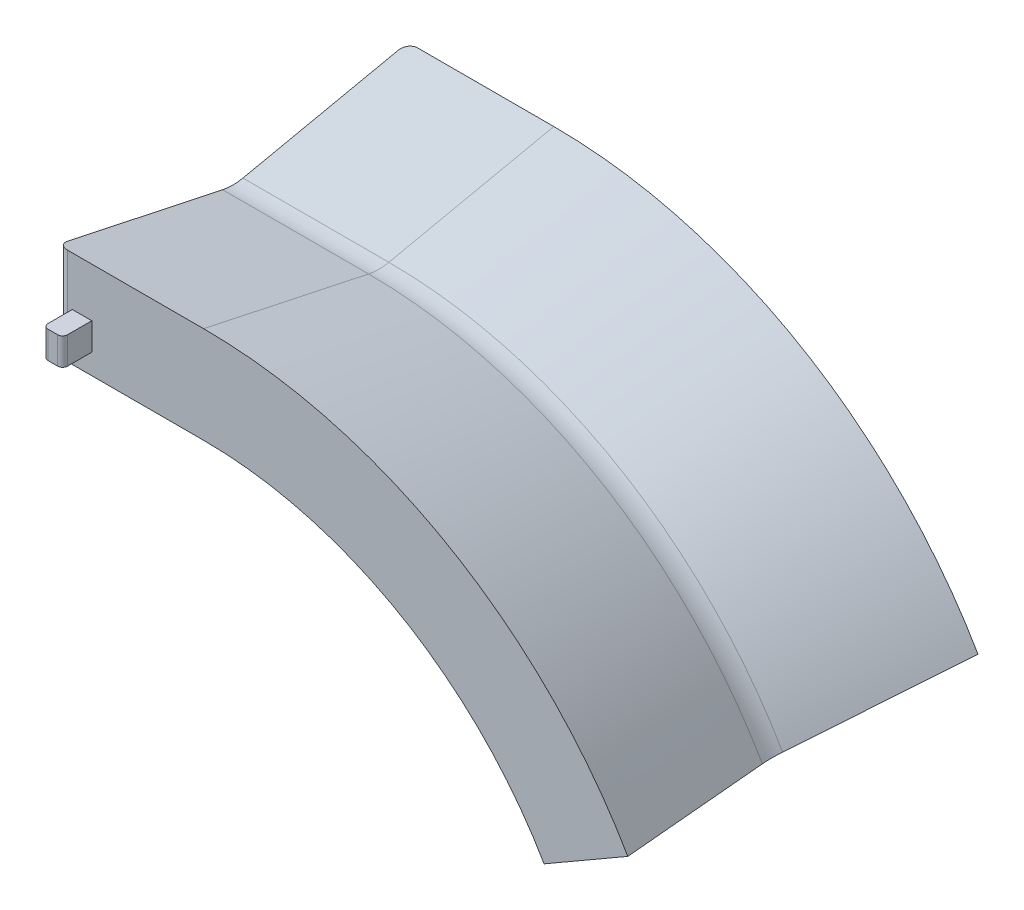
ISO-10303-21;
HEADER;
FILE_DESCRIPTION(('STEP AP214'),'2;1');
FILE_NAME('part.step','',(''),(''),'','','');
FILE_SCHEMA(('AUTOMOTIVE_DESIGN { 1 0 10303 214 1 1 1 1 }'));
ENDSEC;
DATA;
#1=APPLICATION_CONTEXT('core data for automotive mechanical design processes');
#2=APPLICATION_PROTOCOL_DEFINITION('international standard','automotive_design',2000,#1);
#3=PRODUCT_CONTEXT('',#1,'mechanical');
#4=PRODUCT('Part','Part','',(#3));
#5=PRODUCT_RELATED_PRODUCT_CATEGORY('part','',(#4));
#6=PRODUCT_DEFINITION_FORMATION('','',#4);
#7=PRODUCT_DEFINITION_CONTEXT('part definition',#1,'design');
#8=PRODUCT_DEFINITION('design','',#6,#7);
#9=PRODUCT_DEFINITION_SHAPE('','',#8);
#10=(LENGTH_UNIT() NAMED_UNIT(*) SI_UNIT(.MILLI.,.METRE.));
#11=(NAMED_UNIT(*) PLANE_ANGLE_UNIT() SI_UNIT($,.RADIAN.));
#12=(NAMED_UNIT(*) SI_UNIT($,.STERADIAN.) SOLID_ANGLE_UNIT());
#13=UNCERTAINTY_MEASURE_WITH_UNIT(LENGTH_MEASURE(1.E-05),#10,'distance_accuracy_value','');
#14=(GEOMETRIC_REPRESENTATION_CONTEXT(3) GLOBAL_UNCERTAINTY_ASSIGNED_CONTEXT((#13)) GLOBAL_UNIT_ASSIGNED_CONTEXT((#10,
#11,#12)) REPRESENTATION_CONTEXT('',''));
#15=CARTESIAN_POINT('',(0.,0.,0.));
#16=DIRECTION('',(0.,0.,1.));
#17=DIRECTION('',(1.,0.,0.));
#18=AXIS2_PLACEMENT_3D('',#15,#16,#17);
#19=CARTESIAN_POINT('',(15.,9.93929936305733,-18.));
#20=DIRECTION('',(0.,0.,1.));
#21=DIRECTION('',(1.,0.,0.));
#22=AXIS2_PLACEMENT_3D('',#19,#20,#21);
#23=PLANE('',#22);
#24=DIRECTION('',(-1.,0.,0.));
#25=VECTOR('',#24,1.);
#26=CARTESIAN_POINT('',(15.,0.,-18.));
#27=LINE('',#26,#25);
#28=CARTESIAN_POINT('',(15.,0.,-18.));
#29=VERTEX_POINT('',#28);
#30=CARTESIAN_POINT('',(1.,0.,-18.));
#31=VERTEX_POINT('',#30);
#32=EDGE_CURVE('E317',#29,#31,#27,.T.);
#33=ORIENTED_EDGE('',*,*,#32,.T.);
#34=DIRECTION('',(0.,1.,0.));
#35=VECTOR('',#34,1.);
#36=CARTESIAN_POINT('',(1.,9.93929936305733,-18.));
#37=LINE('',#36,#35);
#38=CARTESIAN_POINT('',(1.,9.93929936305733,-18.));
#39=VERTEX_POINT('',#38);
#40=EDGE_CURVE('E365',#31,#39,#37,.T.);
#41=ORIENTED_EDGE('',*,*,#40,.T.);
#42=DIRECTION('',(-1.,0.,0.));
#43=VECTOR('',#42,1.);
#44=CARTESIAN_POINT('',(15.,9.93929936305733,-18.));
#45=LINE('',#44,#43);
#46=CARTESIAN_POINT('',(15.,9.93929936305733,-18.));
#47=VERTEX_POINT('',#46);
#48=EDGE_CURVE('E314',#47,#39,#45,.T.);
#49=ORIENTED_EDGE('',*,*,#48,.F.);
#50=CARTESIAN_POINT('',(15.,-40.4145188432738,-18.));
#51=DIRECTION('',(0.,0.,-1.));
#52=DIRECTION('',(-1.,0.,0.));
#53=AXIS2_PLACEMENT_3D('',#50,#51,#52);
#54=CIRCLE('',#53,50.3538182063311);
#55=CARTESIAN_POINT('',(58.6076857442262,-15.2376097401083,-18.));
#56=VERTEX_POINT('',#55);
#57=EDGE_CURVE('E350',#47,#56,#54,.T.);
#58=ORIENTED_EDGE('',*,*,#57,.T.);
#59=DIRECTION('',(0.86602540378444,0.499999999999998,0.));
#60=VECTOR('',#59,1.);
#61=CARTESIAN_POINT('',(58.6076857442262,-15.2376097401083,-18.));
#62=LINE('',#61,#60);
#63=CARTESIAN_POINT('',(50.,-20.207259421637,-18.));
#64=VERTEX_POINT('',#63);
#65=EDGE_CURVE('E335',#64,#56,#62,.T.);
#66=ORIENTED_EDGE('',*,*,#65,.F.);
#67=CARTESIAN_POINT('',(15.,-40.4145188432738,-18.));
#68=DIRECTION('',(0.,0.,-1.));
#69=DIRECTION('',(-1.,0.,0.));
#70=AXIS2_PLACEMENT_3D('',#67,#68,#69);
#71=CIRCLE('',#70,40.4145188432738);
#72=EDGE_CURVE('E353',#29,#64,#71,.T.);
#73=ORIENTED_EDGE('',*,*,#72,.F.);
#74=EDGE_LOOP('',(#33,#41,#49,#58,#66,#73));
#75=FACE_BOUND('',#74,.T.);
#76=DIRECTION('',(-1.,0.,0.));
#77=VECTOR('',#76,1.);
#78=CARTESIAN_POINT('',(1.5,2.1,-18.));
#79=LINE('',#78,#77);
#80=CARTESIAN_POINT('',(3.5,2.1,-18.));
#81=VERTEX_POINT('',#80);
#82=CARTESIAN_POINT('',(1.5,2.1,-18.));
#83=VERTEX_POINT('',#82);
#84=EDGE_CURVE('E195',#81,#83,#79,.T.);
#85=ORIENTED_EDGE('',*,*,#84,.F.);
#86=DIRECTION('',(0.,1.,0.));
#87=VECTOR('',#86,1.);
#88=CARTESIAN_POINT('',(3.5,2.1,-18.));
#89=LINE('',#88,#87);
#90=CARTESIAN_POINT('',(3.5,4.9,-18.));
#91=VERTEX_POINT('',#90);
#92=EDGE_CURVE('E203',#81,#91,#89,.T.);
#93=ORIENTED_EDGE('',*,*,#92,.T.);
#94=DIRECTION('',(-1.,0.,0.));
#95=VECTOR('',#94,1.);
#96=CARTESIAN_POINT('',(1.5,4.9,-18.));
#97=LINE('',#96,#95);
#98=CARTESIAN_POINT('',(1.5,4.9,-18.));
#99=VERTEX_POINT('',#98);
#100=EDGE_CURVE('E224',#91,#99,#97,.T.);
#101=ORIENTED_EDGE('',*,*,#100,.T.);
#102=DIRECTION('',(0.,1.,0.));
#103=VECTOR('',#102,1.);
#104=CARTESIAN_POINT('',(1.5,2.1,-18.));
#105=LINE('',#104,#103);
#106=EDGE_CURVE('E50',#83,#99,#105,.T.);
#107=ORIENTED_EDGE('',*,*,#106,.F.);
#108=EDGE_LOOP('',(#85,#93,#101,#107));
#109=FACE_BOUND('',#108,.T.);
#110=ADVANCED_FACE('F35',(#75,#109),#23,.F.);
#111=CARTESIAN_POINT('',(15.,9.93929936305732,18.));
#112=DIRECTION('',(0.,0.,-1.));
#113=DIRECTION('',(-1.,0.,0.));
#114=AXIS2_PLACEMENT_3D('',#111,#112,#113);
#115=PLANE('',#114);
#116=DIRECTION('',(-1.,0.,0.));
#117=VECTOR('',#116,1.);
#118=CARTESIAN_POINT('',(15.,9.93929936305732,18.));
#119=LINE('',#118,#117);
#120=CARTESIAN_POINT('',(15.,9.93929936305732,18.));
#121=VERTEX_POINT('',#120);
#122=CARTESIAN_POINT('',(1.,9.93929936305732,18.));
#123=VERTEX_POINT('',#122);
#124=EDGE_CURVE('E323',#121,#123,#119,.T.);
#125=ORIENTED_EDGE('',*,*,#124,.T.);
#126=DIRECTION('',(0.,-1.,0.));
#127=VECTOR('',#126,1.);
#128=CARTESIAN_POINT('',(1.,0.,18.));
#129=LINE('',#128,#127);
#130=CARTESIAN_POINT('',(1.,0.,18.));
#131=VERTEX_POINT('',#130);
#132=EDGE_CURVE('E43',#123,#131,#129,.T.);
#133=ORIENTED_EDGE('',*,*,#132,.T.);
#134=DIRECTION('',(-1.,0.,0.));
#135=VECTOR('',#134,1.);
#136=CARTESIAN_POINT('',(15.,0.,18.));
#137=LINE('',#136,#135);
#138=CARTESIAN_POINT('',(15.,0.,18.));
#139=VERTEX_POINT('',#138);
#140=EDGE_CURVE('E320',#139,#131,#137,.T.);
#141=ORIENTED_EDGE('',*,*,#140,.F.);
#142=CARTESIAN_POINT('',(15.,-40.4145188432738,18.));
#143=DIRECTION('',(0.,0.,-1.));
#144=DIRECTION('',(-1.,0.,0.));
#145=AXIS2_PLACEMENT_3D('',#142,#143,#144);
#146=CIRCLE('',#145,40.4145188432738);
#147=CARTESIAN_POINT('',(50.,-20.207259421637,18.));
#148=VERTEX_POINT('',#147);
#149=EDGE_CURVE('E356',#139,#148,#146,.T.);
#150=ORIENTED_EDGE('',*,*,#149,.T.);
#151=DIRECTION('',(-0.86602540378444,-0.499999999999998,0.));
#152=VECTOR('',#151,1.);
#153=CARTESIAN_POINT('',(58.6076857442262,-15.2376097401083,18.));
#154=LINE('',#153,#152);
#155=CARTESIAN_POINT('',(58.6076857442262,-15.2376097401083,18.));
#156=VERTEX_POINT('',#155);
#157=EDGE_CURVE('E341',#156,#148,#154,.T.);
#158=ORIENTED_EDGE('',*,*,#157,.F.);
#159=CARTESIAN_POINT('',(15.,-40.4145188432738,18.));
#160=DIRECTION('',(0.,0.,-1.));
#161=DIRECTION('',(-1.,0.,0.));
#162=AXIS2_PLACEMENT_3D('',#159,#160,#161);
#163=CIRCLE('',#162,50.3538182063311);
#164=EDGE_CURVE('E359',#121,#156,#163,.T.);
#165=ORIENTED_EDGE('',*,*,#164,.F.);
#166=EDGE_LOOP('',(#125,#133,#141,#150,#158,#165));
#167=FACE_BOUND('',#166,.T.);
#168=DIRECTION('',(-1.,0.,0.));
#169=VECTOR('',#168,1.);
#170=CARTESIAN_POINT('',(1.5,2.1,18.));
#171=LINE('',#170,#169);
#172=CARTESIAN_POINT('',(3.5,2.1,18.));
#173=VERTEX_POINT('',#172);
#174=CARTESIAN_POINT('',(1.5,2.1,18.));
#175=VERTEX_POINT('',#174);
#176=EDGE_CURVE('E244',#173,#175,#171,.T.);
#177=ORIENTED_EDGE('',*,*,#176,.T.);
#178=DIRECTION('',(0.,1.,0.));
#179=VECTOR('',#178,1.);
#180=CARTESIAN_POINT('',(1.5,2.1,18.));
#181=LINE('',#180,#179);
#182=CARTESIAN_POINT('',(1.5,4.9,18.));
#183=VERTEX_POINT('',#182);
#184=EDGE_CURVE('E262',#175,#183,#181,.T.);
#185=ORIENTED_EDGE('',*,*,#184,.T.);
#186=DIRECTION('',(-1.,0.,0.));
#187=VECTOR('',#186,1.);
#188=CARTESIAN_POINT('',(1.5,4.9,18.));
#189=LINE('',#188,#187);
#190=CARTESIAN_POINT('',(3.5,4.9,18.));
#191=VERTEX_POINT('',#190);
#192=EDGE_CURVE('E233',#191,#183,#189,.T.);
#193=ORIENTED_EDGE('',*,*,#192,.F.);
#194=DIRECTION('',(0.,1.,0.));
#195=VECTOR('',#194,1.);
#196=CARTESIAN_POINT('',(3.5,2.1,18.));
#197=LINE('',#196,#195);
#198=EDGE_CURVE('E276',#173,#191,#197,.T.);
#199=ORIENTED_EDGE('',*,*,#198,.F.);
#200=EDGE_LOOP('',(#177,#185,#193,#199));
#201=FACE_BOUND('',#200,.T.);
#202=ADVANCED_FACE('F381',(#167,#201),#115,.F.);
#203=CARTESIAN_POINT('',(15.,-40.4145188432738,1.04041140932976));
#204=DIRECTION('',(0.,0.,1.));
#205=DIRECTION('',(1.,0.,0.));
#206=AXIS2_PLACEMENT_3D('',#203,#204,#205);
#207=CONICAL_SURFACE('',#206,46.7458547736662,0.209613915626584);
#208=DIRECTION('',(0.,0.208082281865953,0.978111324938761));
#209=VECTOR('',#208,1.);
#210=CARTESIAN_POINT('',(15.,9.93929936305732,18.));
#211=LINE('',#210,#209);
#212=CARTESIAN_POINT('',(15.,6.33133593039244,1.04041140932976));
#213=VERTEX_POINT('',#212);
#214=EDGE_CURVE('E292',#213,#121,#211,.T.);
#215=ORIENTED_EDGE('',*,*,#214,.T.);
#216=ORIENTED_EDGE('',*,*,#164,.T.);
#217=DIRECTION('',(0.180204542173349,0.104041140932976,0.978111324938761));
#218=VECTOR('',#217,1.);
#219=CARTESIAN_POINT('',(58.6076857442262,-15.2376097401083,18.));
#220=LINE('',#219,#218);
#221=CARTESIAN_POINT('',(55.4830977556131,-17.0415914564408,1.04041140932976));
#222=VERTEX_POINT('',#221);
#223=EDGE_CURVE('E344',#222,#156,#220,.T.);
#224=ORIENTED_EDGE('',*,*,#223,.F.);
#225=CARTESIAN_POINT('',(15.,-40.4145188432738,1.04041140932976));
#226=DIRECTION('',(0.,0.,-1.));
#227=DIRECTION('',(-1.,0.,0.));
#228=AXIS2_PLACEMENT_3D('',#225,#226,#227);
#229=CIRCLE('',#228,46.7458547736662);
#230=EDGE_CURVE('E362',#213,#222,#229,.T.);
#231=ORIENTED_EDGE('',*,*,#230,.F.);
#232=EDGE_LOOP('',(#215,#216,#224,#231));
#233=FACE_BOUND('',#232,.T.);
#234=ADVANCED_FACE('F396',(#233),#207,.T.);
#235=CARTESIAN_POINT('',(15.,-40.4145188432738,0.));
#236=DIRECTION('',(0.,0.,-1.));
#237=DIRECTION('',(-1.,0.,0.));
#238=AXIS2_PLACEMENT_3D('',#235,#236,#237);
#239=CYLINDRICAL_SURFACE('',#238,40.4145188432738);
#240=DIRECTION('',(0.,0.,-1.));
#241=VECTOR('',#240,1.);
#242=CARTESIAN_POINT('',(15.,0.,18.));
#243=LINE('',#242,#241);
#244=EDGE_CURVE('E296',#139,#29,#243,.T.);
#245=ORIENTED_EDGE('',*,*,#244,.T.);
#246=ORIENTED_EDGE('',*,*,#72,.T.);
#247=DIRECTION('',(0.,0.,-1.));
#248=VECTOR('',#247,1.);
#249=CARTESIAN_POINT('',(50.,-20.207259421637,18.));
#250=LINE('',#249,#248);
#251=EDGE_CURVE('E338',#148,#64,#250,.T.);
#252=ORIENTED_EDGE('',*,*,#251,.F.);
#253=ORIENTED_EDGE('',*,*,#149,.F.);
#254=EDGE_LOOP('',(#245,#246,#252,#253));
#255=FACE_BOUND('',#254,.T.);
#256=ADVANCED_FACE('F392',(#255),#239,.F.);
#257=CARTESIAN_POINT('',(15.,-40.4145188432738,-18.));
#258=DIRECTION('',(0.,0.,-1.));
#259=DIRECTION('',(-1.,0.,0.));
#260=AXIS2_PLACEMENT_3D('',#257,#258,#259);
#261=CONICAL_SURFACE('',#260,50.3538182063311,0.209613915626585);
#262=DIRECTION('',(0.,-0.208082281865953,0.978111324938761));
#263=VECTOR('',#262,1.);
#264=CARTESIAN_POINT('',(15.,9.93929936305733,-18.));
#265=LINE('',#264,#263);
#266=CARTESIAN_POINT('',(15.,6.33133593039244,-1.04041140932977));
#267=VERTEX_POINT('',#266);
#268=EDGE_CURVE('E299',#47,#267,#265,.T.);
#269=ORIENTED_EDGE('',*,*,#268,.T.);
#270=CARTESIAN_POINT('',(15.,-40.4145188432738,-1.04041140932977));
#271=DIRECTION('',(0.,0.,-1.));
#272=DIRECTION('',(-1.,0.,0.));
#273=AXIS2_PLACEMENT_3D('',#270,#271,#272);
#274=CIRCLE('',#273,46.7458547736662);
#275=CARTESIAN_POINT('',(55.4830977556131,-17.0415914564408,-1.04041140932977));
#276=VERTEX_POINT('',#275);
#277=EDGE_CURVE('E347',#267,#276,#274,.T.);
#278=ORIENTED_EDGE('',*,*,#277,.T.);
#279=DIRECTION('',(-0.18020454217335,-0.104041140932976,0.978111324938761));
#280=VECTOR('',#279,1.);
#281=CARTESIAN_POINT('',(58.6076857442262,-15.2376097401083,-18.));
#282=LINE('',#281,#280);
#283=EDGE_CURVE('E332',#56,#276,#282,.T.);
#284=ORIENTED_EDGE('',*,*,#283,.F.);
#285=ORIENTED_EDGE('',*,*,#57,.F.);
#286=EDGE_LOOP('',(#269,#278,#284,#285));
#287=FACE_BOUND('',#286,.T.);
#288=ADVANCED_FACE('F419',(#287),#261,.T.);
#289=CARTESIAN_POINT('',(15.,-40.4145188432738,0.));
#290=DIRECTION('',(0.,0.,-1.));
#291=DIRECTION('',(-1.,0.,0.));
#292=AXIS2_PLACEMENT_3D('',#289,#290,#291);
#293=TOROIDAL_SURFACE('',#292,51.63641139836,5.);
#294=CARTESIAN_POINT('',(15.,11.2218925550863,0.));
#295=DIRECTION('',(-1.,0.,0.));
#296=DIRECTION('',(0.,0.,1.));
#297=AXIS2_PLACEMENT_3D('',#294,#295,#296);
#298=CIRCLE('',#297,5.);
#299=EDGE_CURVE('E289',#267,#213,#298,.T.);
#300=ORIENTED_EDGE('',*,*,#299,.T.);
#301=ORIENTED_EDGE('',*,*,#230,.T.);
#302=CARTESIAN_POINT('',(59.7184440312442,-14.5963131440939,0.));
#303=DIRECTION('',(-0.499999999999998,0.86602540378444,0.));
#304=DIRECTION('',(0.,0.,1.));
#305=AXIS2_PLACEMENT_3D('',#302,#303,#304);
#306=CIRCLE('',#305,5.);
#307=EDGE_CURVE('E329',#276,#222,#306,.T.);
#308=ORIENTED_EDGE('',*,*,#307,.F.);
#309=ORIENTED_EDGE('',*,*,#277,.F.);
#310=EDGE_LOOP('',(#300,#301,#308,#309));
#311=FACE_BOUND('',#310,.T.);
#312=ADVANCED_FACE('F421',(#311),#293,.F.);
#313=CARTESIAN_POINT('',(15.,11.2218925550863,0.));
#314=DIRECTION('',(-1.,0.,0.));
#315=DIRECTION('',(0.,0.,1.));
#316=AXIS2_PLACEMENT_3D('',#313,#314,#315);
#317=CYLINDRICAL_SURFACE('',#316,5.);
#318=CARTESIAN_POINT('',(0.,11.2218925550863,0.));
#319=DIRECTION('',(-1.,0.,0.));
#320=DIRECTION('',(0.,0.,1.));
#321=AXIS2_PLACEMENT_3D('',#318,#319,#320);
#322=CIRCLE('',#321,5.);
#323=CARTESIAN_POINT('',(0.,6.33133593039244,-1.04041140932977));
#324=VERTEX_POINT('',#323);
#325=CARTESIAN_POINT('',(0.,6.33133593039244,1.04041140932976));
#326=VERTEX_POINT('',#325);
#327=EDGE_CURVE('E278',#324,#326,#322,.T.);
#328=ORIENTED_EDGE('',*,*,#327,.T.);
#329=DIRECTION('',(-1.,0.,0.));
#330=VECTOR('',#329,1.);
#331=CARTESIAN_POINT('',(15.,6.33133593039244,1.04041140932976));
#332=LINE('',#331,#330);
#333=EDGE_CURVE('E326',#213,#326,#332,.T.);
#334=ORIENTED_EDGE('',*,*,#333,.F.);
#335=ORIENTED_EDGE('',*,*,#299,.F.);
#336=DIRECTION('',(-1.,0.,0.));
#337=VECTOR('',#336,1.);
#338=CARTESIAN_POINT('',(15.,6.33133593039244,-1.04041140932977));
#339=LINE('',#338,#337);
#340=EDGE_CURVE('E302',#267,#324,#339,.T.);
#341=ORIENTED_EDGE('',*,*,#340,.T.);
#342=EDGE_LOOP('',(#328,#334,#335,#341));
#343=FACE_BOUND('',#342,.T.);
#344=ADVANCED_FACE('F423',(#343),#317,.F.);
#345=CARTESIAN_POINT('',(15.,9.93929936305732,18.));
#346=DIRECTION('',(0.,-0.978111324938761,0.208082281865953));
#347=DIRECTION('',(0.,-0.208082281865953,-0.978111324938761));
#348=AXIS2_PLACEMENT_3D('',#345,#346,#347);
#349=PLANE('',#348);
#350=DIRECTION('',(0.,0.208082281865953,0.978111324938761));
#351=VECTOR('',#350,1.);
#352=CARTESIAN_POINT('',(0.,9.93929936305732,18.));
#353=LINE('',#352,#351);
#354=CARTESIAN_POINT('',(0.,9.72656050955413,17.));
#355=VERTEX_POINT('',#354);
#356=EDGE_CURVE('E305',#326,#355,#353,.T.);
#357=ORIENTED_EDGE('',*,*,#356,.T.);
#358=CARTESIAN_POINT('',(1.,9.72656050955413,17.));
#359=DIRECTION('',(0.,-0.978111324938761,0.208082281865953));
#360=DIRECTION('',(0.,0.208082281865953,0.978111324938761));
#361=AXIS2_PLACEMENT_3D('',#358,#359,#360);
#362=ELLIPSE('',#361,1.02237851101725,1.);
#363=EDGE_CURVE('E11',#355,#123,#362,.F.);
#364=ORIENTED_EDGE('',*,*,#363,.T.);
#365=ORIENTED_EDGE('',*,*,#124,.F.);
#366=ORIENTED_EDGE('',*,*,#214,.F.);
#367=ORIENTED_EDGE('',*,*,#333,.T.);
#368=EDGE_LOOP('',(#357,#364,#365,#366,#367));
#369=FACE_BOUND('',#368,.T.);
#370=ADVANCED_FACE('F400',(#369),#349,.F.);
#371=CARTESIAN_POINT('',(15.,0.,18.));
#372=DIRECTION('',(0.,1.,0.));
#373=DIRECTION('',(0.,0.,1.));
#374=AXIS2_PLACEMENT_3D('',#371,#372,#373);
#375=PLANE('',#374);
#376=DIRECTION('',(0.,0.,-1.));
#377=VECTOR('',#376,1.);
#378=CARTESIAN_POINT('',(0.,0.,18.));
#379=LINE('',#378,#377);
#380=CARTESIAN_POINT('',(0.,0.,17.));
#381=VERTEX_POINT('',#380);
#382=CARTESIAN_POINT('',(0.,0.,-17.));
#383=VERTEX_POINT('',#382);
#384=EDGE_CURVE('E308',#381,#383,#379,.T.);
#385=ORIENTED_EDGE('',*,*,#384,.T.);
#386=CARTESIAN_POINT('',(1.,0.,-17.));
#387=DIRECTION('',(0.,1.,0.));
#388=DIRECTION('',(0.,0.,1.));
#389=AXIS2_PLACEMENT_3D('',#386,#387,#388);
#390=CIRCLE('',#389,1.);
#391=EDGE_CURVE('E376',#383,#31,#390,.F.);
#392=ORIENTED_EDGE('',*,*,#391,.T.);
#393=ORIENTED_EDGE('',*,*,#32,.F.);
#394=ORIENTED_EDGE('',*,*,#244,.F.);
#395=ORIENTED_EDGE('',*,*,#140,.T.);
#396=CARTESIAN_POINT('',(1.,0.,17.));
#397=DIRECTION('',(0.,1.,0.));
#398=DIRECTION('',(0.,0.,1.));
#399=AXIS2_PLACEMENT_3D('',#396,#397,#398);
#400=CIRCLE('',#399,1.);
#401=EDGE_CURVE('E374',#131,#381,#400,.F.);
#402=ORIENTED_EDGE('',*,*,#401,.T.);
#403=EDGE_LOOP('',(#385,#392,#393,#394,#395,#402));
#404=FACE_BOUND('',#403,.T.);
#405=ADVANCED_FACE('F388',(#404),#375,.F.);
#406=CARTESIAN_POINT('',(15.,9.93929936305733,-18.));
#407=DIRECTION('',(0.,-0.978111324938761,-0.208082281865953));
#408=DIRECTION('',(0.,0.208082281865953,-0.978111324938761));
#409=AXIS2_PLACEMENT_3D('',#406,#407,#408);
#410=PLANE('',#409);
#411=ORIENTED_EDGE('',*,*,#48,.T.);
#412=CARTESIAN_POINT('',(1.,9.72656050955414,-17.));
#413=DIRECTION('',(0.,-0.978111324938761,-0.208082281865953));
#414=DIRECTION('',(0.,-0.208082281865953,0.978111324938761));
#415=AXIS2_PLACEMENT_3D('',#412,#413,#414);
#416=ELLIPSE('',#415,1.02237851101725,1.);
#417=CARTESIAN_POINT('',(0.,9.72656050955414,-17.));
#418=VERTEX_POINT('',#417);
#419=EDGE_CURVE('E368',#39,#418,#416,.F.);
#420=ORIENTED_EDGE('',*,*,#419,.T.);
#421=DIRECTION('',(0.,-0.208082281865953,0.978111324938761));
#422=VECTOR('',#421,1.);
#423=CARTESIAN_POINT('',(0.,9.93929936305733,-18.));
#424=LINE('',#423,#422);
#425=EDGE_CURVE('E293',#418,#324,#424,.T.);
#426=ORIENTED_EDGE('',*,*,#425,.T.);
#427=ORIENTED_EDGE('',*,*,#340,.F.);
#428=ORIENTED_EDGE('',*,*,#268,.F.);
#429=EDGE_LOOP('',(#411,#420,#426,#427,#428));
#430=FACE_BOUND('',#429,.T.);
#431=ADVANCED_FACE('F415',(#430),#410,.F.);
#432=CARTESIAN_POINT('',(59.7184440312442,-14.5963131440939,0.));
#433=DIRECTION('',(-0.499999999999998,0.86602540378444,0.));
#434=DIRECTION('',(0.,0.,1.));
#435=AXIS2_PLACEMENT_3D('',#432,#433,#434);
#436=PLANE('',#435);
#437=ORIENTED_EDGE('',*,*,#307,.T.);
#438=ORIENTED_EDGE('',*,*,#223,.T.);
#439=ORIENTED_EDGE('',*,*,#157,.T.);
#440=ORIENTED_EDGE('',*,*,#251,.T.);
#441=ORIENTED_EDGE('',*,*,#65,.T.);
#442=ORIENTED_EDGE('',*,*,#283,.T.);
#443=EDGE_LOOP('',(#437,#438,#439,#440,#441,#442));
#444=FACE_BOUND('',#443,.T.);
#445=ADVANCED_FACE('F394',(#444),#436,.F.);
#446=CARTESIAN_POINT('',(0.,11.2218925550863,0.));
#447=DIRECTION('',(-1.,0.,0.));
#448=DIRECTION('',(0.,0.,1.));
#449=AXIS2_PLACEMENT_3D('',#446,#447,#448);
#450=PLANE('',#449);
#451=ORIENTED_EDGE('',*,*,#425,.F.);
#452=DIRECTION('',(0.,1.,0.));
#453=VECTOR('',#452,1.);
#454=CARTESIAN_POINT('',(0.,0.,-17.));
#455=LINE('',#454,#453);
#456=EDGE_CURVE('E372',#418,#383,#455,.F.);
#457=ORIENTED_EDGE('',*,*,#456,.T.);
#458=ORIENTED_EDGE('',*,*,#384,.F.);
#459=DIRECTION('',(0.,-1.,0.));
#460=VECTOR('',#459,1.);
#461=CARTESIAN_POINT('',(0.,9.93929936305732,17.));
#462=LINE('',#461,#460);
#463=EDGE_CURVE('E370',#381,#355,#462,.F.);
#464=ORIENTED_EDGE('',*,*,#463,.T.);
#465=ORIENTED_EDGE('',*,*,#356,.F.);
#466=ORIENTED_EDGE('',*,*,#327,.F.);
#467=EDGE_LOOP('',(#451,#457,#458,#464,#465,#466));
#468=FACE_BOUND('',#467,.T.);
#469=ADVANCED_FACE('F404',(#468),#450,.T.);
#470=CARTESIAN_POINT('',(1.,9.93929936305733,-17.));
#471=DIRECTION('',(0.,-1.,0.));
#472=DIRECTION('',(0.,0.,-1.));
#473=AXIS2_PLACEMENT_3D('',#470,#471,#472);
#474=CYLINDRICAL_SURFACE('',#473,1.);
#475=ORIENTED_EDGE('',*,*,#391,.F.);
#476=ORIENTED_EDGE('',*,*,#456,.F.);
#477=ORIENTED_EDGE('',*,*,#419,.F.);
#478=ORIENTED_EDGE('',*,*,#40,.F.);
#479=EDGE_LOOP('',(#475,#476,#477,#478));
#480=FACE_BOUND('',#479,.T.);
#481=ADVANCED_FACE('F410',(#480),#474,.T.);
#482=CARTESIAN_POINT('',(1.,9.93929936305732,17.));
#483=DIRECTION('',(0.,1.,0.));
#484=DIRECTION('',(0.,0.,1.));
#485=AXIS2_PLACEMENT_3D('',#482,#483,#484);
#486=CYLINDRICAL_SURFACE('',#485,1.);
#487=ORIENTED_EDGE('',*,*,#363,.F.);
#488=ORIENTED_EDGE('',*,*,#463,.F.);
#489=ORIENTED_EDGE('',*,*,#401,.F.);
#490=ORIENTED_EDGE('',*,*,#132,.F.);
#491=EDGE_LOOP('',(#487,#488,#489,#490));
#492=FACE_BOUND('',#491,.T.);
#493=ADVANCED_FACE('F37',(#492),#486,.T.);
#494=CARTESIAN_POINT('',(3.5,2.1,20.5));
#495=DIRECTION('',(1.,0.,0.));
#496=DIRECTION('',(0.,0.,-1.));
#497=AXIS2_PLACEMENT_3D('',#494,#495,#496);
#498=PLANE('',#497);
#499=DIRECTION('',(0.,0.,-1.));
#500=VECTOR('',#499,1.);
#501=CARTESIAN_POINT('',(3.5,4.9,20.5));
#502=LINE('',#501,#500);
#503=CARTESIAN_POINT('',(3.5,4.9,20.5));
#504=VERTEX_POINT('',#503);
#505=EDGE_CURVE('E58',#504,#191,#502,.T.);
#506=ORIENTED_EDGE('',*,*,#505,.F.);
#507=DIRECTION('',(0.,1.,0.));
#508=VECTOR('',#507,1.);
#509=CARTESIAN_POINT('',(3.5,2.1,20.5));
#510=LINE('',#509,#508);
#511=CARTESIAN_POINT('',(3.5,2.1,20.5));
#512=VERTEX_POINT('',#511);
#513=EDGE_CURVE('E279',#512,#504,#510,.T.);
#514=ORIENTED_EDGE('',*,*,#513,.F.);
#515=DIRECTION('',(0.,0.,-1.));
#516=VECTOR('',#515,1.);
#517=CARTESIAN_POINT('',(3.5,2.1,20.5));
#518=LINE('',#517,#516);
#519=EDGE_CURVE('E259',#512,#173,#518,.T.);
#520=ORIENTED_EDGE('',*,*,#519,.T.);
#521=ORIENTED_EDGE('',*,*,#198,.T.);
#522=EDGE_LOOP('',(#506,#514,#520,#521));
#523=FACE_BOUND('',#522,.T.);
#524=ADVANCED_FACE('F473',(#523),#498,.T.);
#525=CARTESIAN_POINT('',(3.,2.1,20.5));
#526=DIRECTION('',(0.,1.,0.));
#527=DIRECTION('',(0.,0.,1.));
#528=AXIS2_PLACEMENT_3D('',#525,#526,#527);
#529=CYLINDRICAL_SURFACE('',#528,0.5);
#530=CARTESIAN_POINT('',(3.,4.9,20.5));
#531=DIRECTION('',(0.,1.,0.));
#532=DIRECTION('',(0.,0.,1.));
#533=AXIS2_PLACEMENT_3D('',#530,#531,#532);
#534=CIRCLE('',#533,0.5);
#535=CARTESIAN_POINT('',(3.,4.9,21.));
#536=VERTEX_POINT('',#535);
#537=EDGE_CURVE('E273',#536,#504,#534,.T.);
#538=ORIENTED_EDGE('',*,*,#537,.F.);
#539=DIRECTION('',(0.,1.,0.));
#540=VECTOR('',#539,1.);
#541=CARTESIAN_POINT('',(3.,2.1,21.));
#542=LINE('',#541,#540);
#543=CARTESIAN_POINT('',(3.,2.1,21.));
#544=VERTEX_POINT('',#543);
#545=EDGE_CURVE('E281',#544,#536,#542,.T.);
#546=ORIENTED_EDGE('',*,*,#545,.F.);
#547=CARTESIAN_POINT('',(3.,2.1,20.5));
#548=DIRECTION('',(0.,1.,0.));
#549=DIRECTION('',(0.,0.,1.));
#550=AXIS2_PLACEMENT_3D('',#547,#548,#549);
#551=CIRCLE('',#550,0.5);
#552=EDGE_CURVE('E256',#544,#512,#551,.T.);
#553=ORIENTED_EDGE('',*,*,#552,.T.);
#554=ORIENTED_EDGE('',*,*,#513,.T.);
#555=EDGE_LOOP('',(#538,#546,#553,#554));
#556=FACE_BOUND('',#555,.T.);
#557=ADVANCED_FACE('F469',(#556),#529,.T.);
#558=CARTESIAN_POINT('',(2.,2.1,21.));
#559=DIRECTION('',(0.,0.,1.));
#560=DIRECTION('',(1.,0.,0.));
#561=AXIS2_PLACEMENT_3D('',#558,#559,#560);
#562=PLANE('',#561);
#563=DIRECTION('',(1.,0.,0.));
#564=VECTOR('',#563,1.);
#565=CARTESIAN_POINT('',(2.,4.9,21.));
#566=LINE('',#565,#564);
#567=CARTESIAN_POINT('',(2.,4.9,21.));
#568=VERTEX_POINT('',#567);
#569=EDGE_CURVE('E270',#568,#536,#566,.T.);
#570=ORIENTED_EDGE('',*,*,#569,.F.);
#571=DIRECTION('',(0.,1.,0.));
#572=VECTOR('',#571,1.);
#573=CARTESIAN_POINT('',(2.,2.1,21.));
#574=LINE('',#573,#572);
#575=CARTESIAN_POINT('',(2.,2.1,21.));
#576=VERTEX_POINT('',#575);
#577=EDGE_CURVE('E283',#576,#568,#574,.T.);
#578=ORIENTED_EDGE('',*,*,#577,.F.);
#579=DIRECTION('',(1.,0.,0.));
#580=VECTOR('',#579,1.);
#581=CARTESIAN_POINT('',(2.,2.1,21.));
#582=LINE('',#581,#580);
#583=EDGE_CURVE('E253',#576,#544,#582,.T.);
#584=ORIENTED_EDGE('',*,*,#583,.T.);
#585=ORIENTED_EDGE('',*,*,#545,.T.);
#586=EDGE_LOOP('',(#570,#578,#584,#585));
#587=FACE_BOUND('',#586,.T.);
#588=ADVANCED_FACE('F465',(#587),#562,.T.);
#589=CARTESIAN_POINT('',(2.,2.1,20.5));
#590=DIRECTION('',(0.,1.,0.));
#591=DIRECTION('',(0.,0.,1.));
#592=AXIS2_PLACEMENT_3D('',#589,#590,#591);
#593=CYLINDRICAL_SURFACE('',#592,0.5);
#594=CARTESIAN_POINT('',(2.,4.9,20.5));
#595=DIRECTION('',(0.,1.,0.));
#596=DIRECTION('',(0.,0.,1.));
#597=AXIS2_PLACEMENT_3D('',#594,#595,#596);
#598=CIRCLE('',#597,0.5);
#599=CARTESIAN_POINT('',(1.5,4.9,20.5));
#600=VERTEX_POINT('',#599);
#601=EDGE_CURVE('E267',#600,#568,#598,.T.);
#602=ORIENTED_EDGE('',*,*,#601,.F.);
#603=DIRECTION('',(0.,1.,0.));
#604=VECTOR('',#603,1.);
#605=CARTESIAN_POINT('',(1.5,2.1,20.5));
#606=LINE('',#605,#604);
#607=CARTESIAN_POINT('',(1.5,2.1,20.5));
#608=VERTEX_POINT('',#607);
#609=EDGE_CURVE('E285',#608,#600,#606,.T.);
#610=ORIENTED_EDGE('',*,*,#609,.F.);
#611=CARTESIAN_POINT('',(2.,2.1,20.5));
#612=DIRECTION('',(0.,1.,0.));
#613=DIRECTION('',(0.,0.,1.));
#614=AXIS2_PLACEMENT_3D('',#611,#612,#613);
#615=CIRCLE('',#614,0.5);
#616=EDGE_CURVE('E250',#608,#576,#615,.T.);
#617=ORIENTED_EDGE('',*,*,#616,.T.);
#618=ORIENTED_EDGE('',*,*,#577,.T.);
#619=EDGE_LOOP('',(#602,#610,#617,#618));
#620=FACE_BOUND('',#619,.T.);
#621=ADVANCED_FACE('F461',(#620),#593,.T.);
#622=CARTESIAN_POINT('',(1.5,2.1,18.));
#623=DIRECTION('',(-1.,0.,0.));
#624=DIRECTION('',(0.,0.,1.));
#625=AXIS2_PLACEMENT_3D('',#622,#623,#624);
#626=PLANE('',#625);
#627=DIRECTION('',(0.,0.,1.));
#628=VECTOR('',#627,1.);
#629=CARTESIAN_POINT('',(1.5,4.9,18.));
#630=LINE('',#629,#628);
#631=EDGE_CURVE('E264',#183,#600,#630,.T.);
#632=ORIENTED_EDGE('',*,*,#631,.F.);
#633=ORIENTED_EDGE('',*,*,#184,.F.);
#634=DIRECTION('',(0.,0.,1.));
#635=VECTOR('',#634,1.);
#636=CARTESIAN_POINT('',(1.5,2.1,18.));
#637=LINE('',#636,#635);
#638=EDGE_CURVE('E247',#175,#608,#637,.T.);
#639=ORIENTED_EDGE('',*,*,#638,.T.);
#640=ORIENTED_EDGE('',*,*,#609,.T.);
#641=EDGE_LOOP('',(#632,#633,#639,#640));
#642=FACE_BOUND('',#641,.T.);
#643=ADVANCED_FACE('F457',(#642),#626,.T.);
#644=CARTESIAN_POINT('',(3.,2.1,20.5));
#645=DIRECTION('',(0.,1.,0.));
#646=DIRECTION('',(0.,0.,1.));
#647=AXIS2_PLACEMENT_3D('',#644,#645,#646);
#648=PLANE('',#647);
#649=ORIENTED_EDGE('',*,*,#176,.F.);
#650=ORIENTED_EDGE('',*,*,#519,.F.);
#651=ORIENTED_EDGE('',*,*,#552,.F.);
#652=ORIENTED_EDGE('',*,*,#583,.F.);
#653=ORIENTED_EDGE('',*,*,#616,.F.);
#654=ORIENTED_EDGE('',*,*,#638,.F.);
#655=EDGE_LOOP('',(#649,#650,#651,#652,#653,#654));
#656=FACE_BOUND('',#655,.T.);
#657=ADVANCED_FACE('F460',(#656),#648,.F.);
#658=CARTESIAN_POINT('',(3.,4.9,20.5));
#659=DIRECTION('',(0.,1.,0.));
#660=DIRECTION('',(0.,0.,1.));
#661=AXIS2_PLACEMENT_3D('',#658,#659,#660);
#662=PLANE('',#661);
#663=ORIENTED_EDGE('',*,*,#192,.T.);
#664=ORIENTED_EDGE('',*,*,#631,.T.);
#665=ORIENTED_EDGE('',*,*,#601,.T.);
#666=ORIENTED_EDGE('',*,*,#569,.T.);
#667=ORIENTED_EDGE('',*,*,#537,.T.);
#668=ORIENTED_EDGE('',*,*,#505,.T.);
#669=EDGE_LOOP('',(#663,#664,#665,#666,#667,#668));
#670=FACE_BOUND('',#669,.T.);
#671=ADVANCED_FACE('F478',(#670),#662,.T.);
#672=CARTESIAN_POINT('',(1.5,2.1,-18.));
#673=DIRECTION('',(1.,0.,0.));
#674=DIRECTION('',(0.,0.,-1.));
#675=AXIS2_PLACEMENT_3D('',#672,#673,#674);
#676=PLANE('',#675);
#677=DIRECTION('',(0.,0.,-1.));
#678=VECTOR('',#677,1.);
#679=CARTESIAN_POINT('',(1.5,4.9,-18.));
#680=LINE('',#679,#678);
#681=CARTESIAN_POINT('',(1.5,4.9,-20.5));
#682=VERTEX_POINT('',#681);
#683=EDGE_CURVE('E213',#99,#682,#680,.T.);
#684=ORIENTED_EDGE('',*,*,#683,.T.);
#685=DIRECTION('',(0.,1.,0.));
#686=VECTOR('',#685,1.);
#687=CARTESIAN_POINT('',(1.5,2.1,-20.5));
#688=LINE('',#687,#686);
#689=CARTESIAN_POINT('',(1.5,2.1,-20.5));
#690=VERTEX_POINT('',#689);
#691=EDGE_CURVE('E234',#690,#682,#688,.T.);
#692=ORIENTED_EDGE('',*,*,#691,.F.);
#693=DIRECTION('',(0.,0.,-1.));
#694=VECTOR('',#693,1.);
#695=CARTESIAN_POINT('',(1.5,2.1,-18.));
#696=LINE('',#695,#694);
#697=EDGE_CURVE('E211',#83,#690,#696,.T.);
#698=ORIENTED_EDGE('',*,*,#697,.F.);
#699=ORIENTED_EDGE('',*,*,#106,.T.);
#700=EDGE_LOOP('',(#684,#692,#698,#699));
#701=FACE_BOUND('',#700,.T.);
#702=ADVANCED_FACE('F481',(#701),#676,.F.);
#703=CARTESIAN_POINT('',(2.,2.1,-20.5));
#704=DIRECTION('',(0.,1.,0.));
#705=DIRECTION('',(0.,0.,1.));
#706=AXIS2_PLACEMENT_3D('',#703,#704,#705);
#707=CYLINDRICAL_SURFACE('',#706,0.5);
#708=CARTESIAN_POINT('',(2.,4.9,-20.5));
#709=DIRECTION('',(0.,-1.,0.));
#710=DIRECTION('',(0.,0.,-1.));
#711=AXIS2_PLACEMENT_3D('',#708,#709,#710);
#712=CIRCLE('',#711,0.5);
#713=CARTESIAN_POINT('',(2.,4.9,-21.));
#714=VERTEX_POINT('',#713);
#715=EDGE_CURVE('E215',#682,#714,#712,.T.);
#716=ORIENTED_EDGE('',*,*,#715,.T.);
#717=DIRECTION('',(0.,1.,0.));
#718=VECTOR('',#717,1.);
#719=CARTESIAN_POINT('',(2.,2.1,-21.));
#720=LINE('',#719,#718);
#721=CARTESIAN_POINT('',(2.,2.1,-21.));
#722=VERTEX_POINT('',#721);
#723=EDGE_CURVE('E237',#722,#714,#720,.T.);
#724=ORIENTED_EDGE('',*,*,#723,.F.);
#725=CARTESIAN_POINT('',(2.,2.1,-20.5));
#726=DIRECTION('',(0.,-1.,0.));
#727=DIRECTION('',(0.,0.,-1.));
#728=AXIS2_PLACEMENT_3D('',#725,#726,#727);
#729=CIRCLE('',#728,0.5);
#730=EDGE_CURVE('E221',#690,#722,#729,.T.);
#731=ORIENTED_EDGE('',*,*,#730,.F.);
#732=ORIENTED_EDGE('',*,*,#691,.T.);
#733=EDGE_LOOP('',(#716,#724,#731,#732));
#734=FACE_BOUND('',#733,.T.);
#735=ADVANCED_FACE('F494',(#734),#707,.T.);
#736=CARTESIAN_POINT('',(2.,2.1,-21.));
#737=DIRECTION('',(0.,0.,1.));
#738=DIRECTION('',(1.,0.,0.));
#739=AXIS2_PLACEMENT_3D('',#736,#737,#738);
#740=PLANE('',#739);
#741=DIRECTION('',(1.,0.,0.));
#742=VECTOR('',#741,1.);
#743=CARTESIAN_POINT('',(2.,4.9,-21.));
#744=LINE('',#743,#742);
#745=CARTESIAN_POINT('',(3.,4.9,-21.));
#746=VERTEX_POINT('',#745);
#747=EDGE_CURVE('E229',#714,#746,#744,.T.);
#748=ORIENTED_EDGE('',*,*,#747,.T.);
#749=DIRECTION('',(0.,1.,0.));
#750=VECTOR('',#749,1.);
#751=CARTESIAN_POINT('',(3.,2.1,-21.));
#752=LINE('',#751,#750);
#753=CARTESIAN_POINT('',(3.,2.1,-21.));
#754=VERTEX_POINT('',#753);
#755=EDGE_CURVE('E240',#754,#746,#752,.T.);
#756=ORIENTED_EDGE('',*,*,#755,.F.);
#757=DIRECTION('',(1.,0.,0.));
#758=VECTOR('',#757,1.);
#759=CARTESIAN_POINT('',(2.,2.1,-21.));
#760=LINE('',#759,#758);
#761=EDGE_CURVE('E219',#722,#754,#760,.T.);
#762=ORIENTED_EDGE('',*,*,#761,.F.);
#763=ORIENTED_EDGE('',*,*,#723,.T.);
#764=EDGE_LOOP('',(#748,#756,#762,#763));
#765=FACE_BOUND('',#764,.T.);
#766=ADVANCED_FACE('F490',(#765),#740,.F.);
#767=CARTESIAN_POINT('',(3.,2.1,-20.5));
#768=DIRECTION('',(0.,1.,0.));
#769=DIRECTION('',(0.,0.,1.));
#770=AXIS2_PLACEMENT_3D('',#767,#768,#769);
#771=CYLINDRICAL_SURFACE('',#770,0.5);
#772=CARTESIAN_POINT('',(3.,4.9,-20.5));
#773=DIRECTION('',(0.,-1.,0.));
#774=DIRECTION('',(0.,0.,-1.));
#775=AXIS2_PLACEMENT_3D('',#772,#773,#774);
#776=CIRCLE('',#775,0.5);
#777=CARTESIAN_POINT('',(3.5,4.9,-20.5));
#778=VERTEX_POINT('',#777);
#779=EDGE_CURVE('E227',#746,#778,#776,.T.);
#780=ORIENTED_EDGE('',*,*,#779,.T.);
#781=DIRECTION('',(0.,1.,0.));
#782=VECTOR('',#781,1.);
#783=CARTESIAN_POINT('',(3.5,2.1,-20.5));
#784=LINE('',#783,#782);
#785=CARTESIAN_POINT('',(3.5,2.1,-20.5));
#786=VERTEX_POINT('',#785);
#787=EDGE_CURVE('E210',#786,#778,#784,.T.);
#788=ORIENTED_EDGE('',*,*,#787,.F.);
#789=CARTESIAN_POINT('',(3.,2.1,-20.5));
#790=DIRECTION('',(0.,-1.,0.));
#791=DIRECTION('',(0.,0.,-1.));
#792=AXIS2_PLACEMENT_3D('',#789,#790,#791);
#793=CIRCLE('',#792,0.5);
#794=EDGE_CURVE('E197',#754,#786,#793,.T.);
#795=ORIENTED_EDGE('',*,*,#794,.F.);
#796=ORIENTED_EDGE('',*,*,#755,.T.);
#797=EDGE_LOOP('',(#780,#788,#795,#796));
#798=FACE_BOUND('',#797,.T.);
#799=ADVANCED_FACE('F487',(#798),#771,.T.);
#800=CARTESIAN_POINT('',(3.5,2.1,-20.5));
#801=DIRECTION('',(-1.,0.,0.));
#802=DIRECTION('',(0.,0.,1.));
#803=AXIS2_PLACEMENT_3D('',#800,#801,#802);
#804=PLANE('',#803);
#805=DIRECTION('',(0.,0.,1.));
#806=VECTOR('',#805,1.);
#807=CARTESIAN_POINT('',(3.5,4.9,-20.5));
#808=LINE('',#807,#806);
#809=EDGE_CURVE('E206',#778,#91,#808,.T.);
#810=ORIENTED_EDGE('',*,*,#809,.T.);
#811=ORIENTED_EDGE('',*,*,#92,.F.);
#812=DIRECTION('',(0.,0.,1.));
#813=VECTOR('',#812,1.);
#814=CARTESIAN_POINT('',(3.5,2.1,-20.5));
#815=LINE('',#814,#813);
#816=EDGE_CURVE('E191',#786,#81,#815,.T.);
#817=ORIENTED_EDGE('',*,*,#816,.F.);
#818=ORIENTED_EDGE('',*,*,#787,.T.);
#819=EDGE_LOOP('',(#810,#811,#817,#818));
#820=FACE_BOUND('',#819,.T.);
#821=ADVANCED_FACE('F204',(#820),#804,.F.);
#822=CARTESIAN_POINT('',(3.,2.1,-20.5));
#823=DIRECTION('',(0.,1.,0.));
#824=DIRECTION('',(0.,0.,-1.));
#825=AXIS2_PLACEMENT_3D('',#822,#823,#824);
#826=PLANE('',#825);
#827=ORIENTED_EDGE('',*,*,#84,.T.);
#828=ORIENTED_EDGE('',*,*,#697,.T.);
#829=ORIENTED_EDGE('',*,*,#730,.T.);
#830=ORIENTED_EDGE('',*,*,#761,.T.);
#831=ORIENTED_EDGE('',*,*,#794,.T.);
#832=ORIENTED_EDGE('',*,*,#816,.T.);
#833=EDGE_LOOP('',(#827,#828,#829,#830,#831,#832));
#834=FACE_BOUND('',#833,.T.);
#835=ADVANCED_FACE('F193',(#834),#826,.F.);
#836=CARTESIAN_POINT('',(3.,4.9,-20.5));
#837=DIRECTION('',(0.,1.,0.));
#838=DIRECTION('',(0.,0.,-1.));
#839=AXIS2_PLACEMENT_3D('',#836,#837,#838);
#840=PLANE('',#839);
#841=ORIENTED_EDGE('',*,*,#100,.F.);
#842=ORIENTED_EDGE('',*,*,#809,.F.);
#843=ORIENTED_EDGE('',*,*,#779,.F.);
#844=ORIENTED_EDGE('',*,*,#747,.F.);
#845=ORIENTED_EDGE('',*,*,#715,.F.);
#846=ORIENTED_EDGE('',*,*,#683,.F.);
#847=EDGE_LOOP('',(#841,#842,#843,#844,#845,#846));
#848=FACE_BOUND('',#847,.T.);
#849=ADVANCED_FACE('F501',(#848),#840,.T.);
#850=CLOSED_SHELL('',(#110,#202,#234,#256,#288,#312,#344,#370,#405,#431,#445,#469,#481,#493,
#524,#557,#588,#621,#643,#657,#671,#702,#735,#766,#799,#821,#835,#849));
#851=MANIFOLD_SOLID_BREP('B2',#850);
#852=ADVANCED_BREP_SHAPE_REPRESENTATION('',(#18,#851),#14);
#853=SHAPE_DEFINITION_REPRESENTATION(#9,#852);
ENDSEC;
END-ISO-10303-21;
